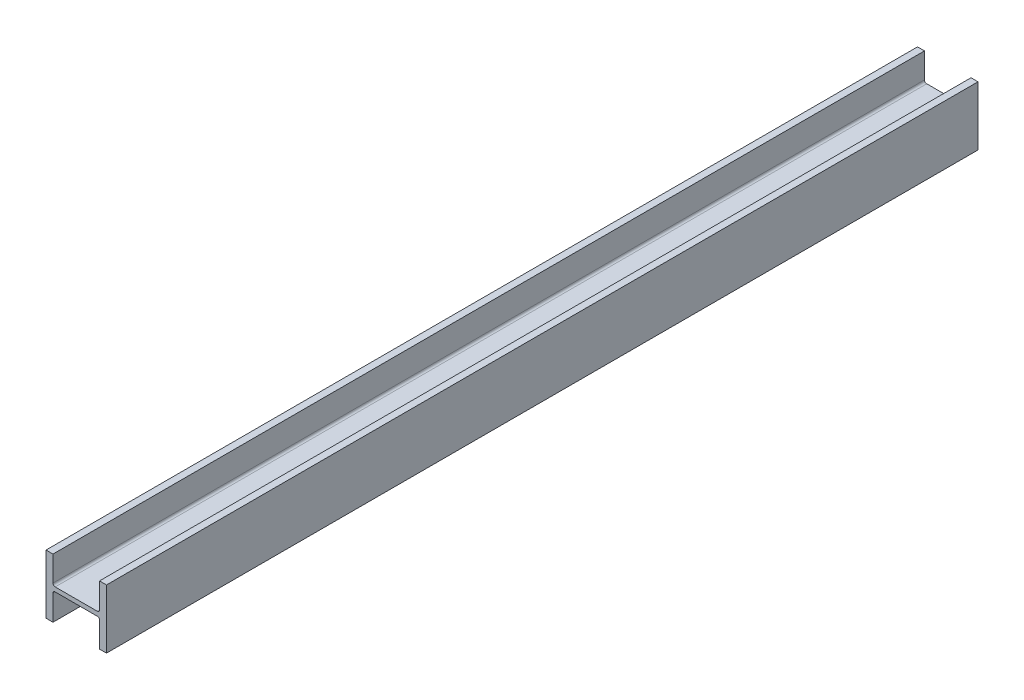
ISO-10303-21;
HEADER;
FILE_DESCRIPTION(('STEP AP214'),'2;1');
FILE_NAME('part.step','',(''),(''),'','','');
FILE_SCHEMA(('AUTOMOTIVE_DESIGN { 1 0 10303 214 1 1 1 1 }'));
ENDSEC;
DATA;
#1=APPLICATION_CONTEXT('core data for automotive mechanical design processes');
#2=APPLICATION_PROTOCOL_DEFINITION('international standard','automotive_design',2000,#1);
#3=PRODUCT_CONTEXT('',#1,'mechanical');
#4=PRODUCT('Part','Part','',(#3));
#5=PRODUCT_RELATED_PRODUCT_CATEGORY('part','',(#4));
#6=PRODUCT_DEFINITION_FORMATION('','',#4);
#7=PRODUCT_DEFINITION_CONTEXT('part definition',#1,'design');
#8=PRODUCT_DEFINITION('design','',#6,#7);
#9=PRODUCT_DEFINITION_SHAPE('','',#8);
#10=(LENGTH_UNIT() NAMED_UNIT(*) SI_UNIT(.MILLI.,.METRE.));
#11=(NAMED_UNIT(*) PLANE_ANGLE_UNIT() SI_UNIT($,.RADIAN.));
#12=(NAMED_UNIT(*) SI_UNIT($,.STERADIAN.) SOLID_ANGLE_UNIT());
#13=UNCERTAINTY_MEASURE_WITH_UNIT(LENGTH_MEASURE(1.E-05),#10,'distance_accuracy_value','');
#14=(GEOMETRIC_REPRESENTATION_CONTEXT(3) GLOBAL_UNCERTAINTY_ASSIGNED_CONTEXT((#13)) GLOBAL_UNIT_ASSIGNED_CONTEXT((#10,
#11,#12)) REPRESENTATION_CONTEXT('',''));
#15=CARTESIAN_POINT('',(0.,0.,0.));
#16=DIRECTION('',(0.,0.,1.));
#17=DIRECTION('',(1.,0.,0.));
#18=AXIS2_PLACEMENT_3D('',#15,#16,#17);
#19=CARTESIAN_POINT('',(208.026,203.1365,2997.2));
#20=DIRECTION('',(-1.,0.,0.));
#21=DIRECTION('',(0.,0.,1.));
#22=AXIS2_PLACEMENT_3D('',#19,#20,#21);
#23=PLANE('',#22);
#24=DIRECTION('',(0.,1.,0.));
#25=VECTOR('',#24,1.);
#26=CARTESIAN_POINT('',(208.026,203.1365,-2997.2));
#27=LINE('',#26,#25);
#28=CARTESIAN_POINT('',(208.026,-203.1365,-2997.2));
#29=VERTEX_POINT('',#28);
#30=CARTESIAN_POINT('',(208.026,203.1365,-2997.2));
#31=VERTEX_POINT('',#30);
#32=EDGE_CURVE('E193',#29,#31,#27,.T.);
#33=ORIENTED_EDGE('',*,*,#32,.T.);
#34=DIRECTION('',(0.,0.,-1.));
#35=VECTOR('',#34,1.);
#36=CARTESIAN_POINT('',(208.026,203.1365,2997.2));
#37=LINE('',#36,#35);
#38=CARTESIAN_POINT('',(208.026,203.1365,2997.2));
#39=VERTEX_POINT('',#38);
#40=EDGE_CURVE('E11',#39,#31,#37,.T.);
#41=ORIENTED_EDGE('',*,*,#40,.F.);
#42=DIRECTION('',(0.,1.,0.));
#43=VECTOR('',#42,1.);
#44=CARTESIAN_POINT('',(208.026,203.1365,2997.2));
#45=LINE('',#44,#43);
#46=CARTESIAN_POINT('',(208.026,-203.1365,2997.2));
#47=VERTEX_POINT('',#46);
#48=EDGE_CURVE('E238',#47,#39,#45,.T.);
#49=ORIENTED_EDGE('',*,*,#48,.F.);
#50=DIRECTION('',(0.,0.,-1.));
#51=VECTOR('',#50,1.);
#52=CARTESIAN_POINT('',(208.026,-203.1365,2997.2));
#53=LINE('',#52,#51);
#54=EDGE_CURVE('E187',#47,#29,#53,.T.);
#55=ORIENTED_EDGE('',*,*,#54,.T.);
#56=EDGE_LOOP('',(#33,#41,#49,#55));
#57=FACE_BOUND('',#56,.T.);
#58=ADVANCED_FACE('F44',(#57),#23,.F.);
#59=CARTESIAN_POINT('',(160.02,203.1365,2997.2));
#60=DIRECTION('',(0.,-1.,0.));
#61=DIRECTION('',(0.,0.,-1.));
#62=AXIS2_PLACEMENT_3D('',#59,#60,#61);
#63=PLANE('',#62);
#64=DIRECTION('',(-1.,0.,0.));
#65=VECTOR('',#64,1.);
#66=CARTESIAN_POINT('',(160.02,203.1365,-2997.2));
#67=LINE('',#66,#65);
#68=CARTESIAN_POINT('',(160.02,203.1365,-2997.2));
#69=VERTEX_POINT('',#68);
#70=EDGE_CURVE('E196',#31,#69,#67,.T.);
#71=ORIENTED_EDGE('',*,*,#70,.T.);
#72=DIRECTION('',(0.,0.,-1.));
#73=VECTOR('',#72,1.);
#74=CARTESIAN_POINT('',(160.02,203.1365,2997.2));
#75=LINE('',#74,#73);
#76=CARTESIAN_POINT('',(160.02,203.1365,2997.2));
#77=VERTEX_POINT('',#76);
#78=EDGE_CURVE('E53',#77,#69,#75,.T.);
#79=ORIENTED_EDGE('',*,*,#78,.F.);
#80=DIRECTION('',(-1.,0.,0.));
#81=VECTOR('',#80,1.);
#82=CARTESIAN_POINT('',(160.02,203.1365,2997.2));
#83=LINE('',#82,#81);
#84=EDGE_CURVE('E129',#39,#77,#83,.T.);
#85=ORIENTED_EDGE('',*,*,#84,.F.);
#86=ORIENTED_EDGE('',*,*,#40,.T.);
#87=EDGE_LOOP('',(#71,#79,#85,#86));
#88=FACE_BOUND('',#87,.T.);
#89=ADVANCED_FACE('F362',(#88),#63,.F.);
#90=CARTESIAN_POINT('',(160.02,30.1625000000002,2997.2));
#91=DIRECTION('',(1.,0.,0.));
#92=DIRECTION('',(0.,0.,-1.));
#93=AXIS2_PLACEMENT_3D('',#90,#91,#92);
#94=PLANE('',#93);
#95=DIRECTION('',(0.,-1.,0.));
#96=VECTOR('',#95,1.);
#97=CARTESIAN_POINT('',(160.02,30.1625000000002,-2997.2));
#98=LINE('',#97,#96);
#99=CARTESIAN_POINT('',(160.02,30.1625000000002,-2997.2));
#100=VERTEX_POINT('',#99);
#101=EDGE_CURVE('E203',#69,#100,#98,.T.);
#102=ORIENTED_EDGE('',*,*,#101,.T.);
#103=DIRECTION('',(0.,0.,-1.));
#104=VECTOR('',#103,1.);
#105=CARTESIAN_POINT('',(160.02,30.1625000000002,2997.2));
#106=LINE('',#105,#104);
#107=CARTESIAN_POINT('',(160.02,30.1625000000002,2997.2));
#108=VERTEX_POINT('',#107);
#109=EDGE_CURVE('E281',#108,#100,#106,.T.);
#110=ORIENTED_EDGE('',*,*,#109,.F.);
#111=DIRECTION('',(0.,-1.,0.));
#112=VECTOR('',#111,1.);
#113=CARTESIAN_POINT('',(160.02,30.1625000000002,2997.2));
#114=LINE('',#113,#112);
#115=EDGE_CURVE('E291',#77,#108,#114,.T.);
#116=ORIENTED_EDGE('',*,*,#115,.F.);
#117=ORIENTED_EDGE('',*,*,#78,.T.);
#118=EDGE_LOOP('',(#102,#110,#116,#117));
#119=FACE_BOUND('',#118,.T.);
#120=ADVANCED_FACE('F292',(#119),#94,.F.);
#121=CARTESIAN_POINT('',(144.78,30.1625000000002,2997.2));
#122=DIRECTION('',(0.,0.,-1.));
#123=DIRECTION('',(-1.,0.,0.));
#124=AXIS2_PLACEMENT_3D('',#121,#122,#123);
#125=CYLINDRICAL_SURFACE('',#124,15.24);
#126=CARTESIAN_POINT('',(144.78,30.1625000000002,-2997.2));
#127=DIRECTION('',(0.,0.,-1.));
#128=DIRECTION('',(1.,0.,0.));
#129=AXIS2_PLACEMENT_3D('',#126,#127,#128);
#130=CIRCLE('',#129,15.24);
#131=CARTESIAN_POINT('',(144.78,14.9225000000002,-2997.2));
#132=VERTEX_POINT('',#131);
#133=EDGE_CURVE('E204',#100,#132,#130,.T.);
#134=ORIENTED_EDGE('',*,*,#133,.T.);
#135=DIRECTION('',(0.,0.,-1.));
#136=VECTOR('',#135,1.);
#137=CARTESIAN_POINT('',(144.78,14.9225000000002,2997.2));
#138=LINE('',#137,#136);
#139=CARTESIAN_POINT('',(144.78,14.9225000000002,2997.2));
#140=VERTEX_POINT('',#139);
#141=EDGE_CURVE('E276',#140,#132,#138,.T.);
#142=ORIENTED_EDGE('',*,*,#141,.F.);
#143=CARTESIAN_POINT('',(144.78,30.1625000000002,2997.2));
#144=DIRECTION('',(0.,0.,-1.));
#145=DIRECTION('',(1.,0.,0.));
#146=AXIS2_PLACEMENT_3D('',#143,#144,#145);
#147=CIRCLE('',#146,15.24);
#148=EDGE_CURVE('E315',#108,#140,#147,.T.);
#149=ORIENTED_EDGE('',*,*,#148,.F.);
#150=ORIENTED_EDGE('',*,*,#109,.T.);
#151=EDGE_LOOP('',(#134,#142,#149,#150));
#152=FACE_BOUND('',#151,.T.);
#153=ADVANCED_FACE('F302',(#152),#125,.F.);
#154=CARTESIAN_POINT('',(-144.78,14.9225000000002,2997.2));
#155=DIRECTION('',(0.,-1.,0.));
#156=DIRECTION('',(1.,0.,0.));
#157=AXIS2_PLACEMENT_3D('',#154,#155,#156);
#158=PLANE('',#157);
#159=DIRECTION('',(-1.,0.,0.));
#160=VECTOR('',#159,1.);
#161=CARTESIAN_POINT('',(-144.78,14.9225000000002,-2997.2));
#162=LINE('',#161,#160);
#163=CARTESIAN_POINT('',(-144.78,14.9225000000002,-2997.2));
#164=VERTEX_POINT('',#163);
#165=EDGE_CURVE('E210',#132,#164,#162,.T.);
#166=ORIENTED_EDGE('',*,*,#165,.T.);
#167=DIRECTION('',(0.,0.,-1.));
#168=VECTOR('',#167,1.);
#169=CARTESIAN_POINT('',(-144.78,14.9225000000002,2997.2));
#170=LINE('',#169,#168);
#171=CARTESIAN_POINT('',(-144.78,14.9225000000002,2997.2));
#172=VERTEX_POINT('',#171);
#173=EDGE_CURVE('E274',#172,#164,#170,.T.);
#174=ORIENTED_EDGE('',*,*,#173,.F.);
#175=DIRECTION('',(-1.,0.,0.));
#176=VECTOR('',#175,1.);
#177=CARTESIAN_POINT('',(-144.78,14.9225000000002,2997.2));
#178=LINE('',#177,#176);
#179=EDGE_CURVE('E306',#140,#172,#178,.T.);
#180=ORIENTED_EDGE('',*,*,#179,.F.);
#181=ORIENTED_EDGE('',*,*,#141,.T.);
#182=EDGE_LOOP('',(#166,#174,#180,#181));
#183=FACE_BOUND('',#182,.T.);
#184=ADVANCED_FACE('F308',(#183),#158,.F.);
#185=CARTESIAN_POINT('',(-144.78,30.1625000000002,2997.2));
#186=DIRECTION('',(0.,0.,-1.));
#187=DIRECTION('',(-1.,0.,0.));
#188=AXIS2_PLACEMENT_3D('',#185,#186,#187);
#189=CYLINDRICAL_SURFACE('',#188,15.24);
#190=CARTESIAN_POINT('',(-144.78,30.1625000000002,-2997.2));
#191=DIRECTION('',(0.,0.,-1.));
#192=DIRECTION('',(1.,0.,0.));
#193=AXIS2_PLACEMENT_3D('',#190,#191,#192);
#194=CIRCLE('',#193,15.24);
#195=CARTESIAN_POINT('',(-160.02,30.1625000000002,-2997.2));
#196=VERTEX_POINT('',#195);
#197=EDGE_CURVE('E209',#164,#196,#194,.T.);
#198=ORIENTED_EDGE('',*,*,#197,.T.);
#199=DIRECTION('',(0.,0.,-1.));
#200=VECTOR('',#199,1.);
#201=CARTESIAN_POINT('',(-160.02,30.1625000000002,2997.2));
#202=LINE('',#201,#200);
#203=CARTESIAN_POINT('',(-160.02,30.1625000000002,2997.2));
#204=VERTEX_POINT('',#203);
#205=EDGE_CURVE('E271',#204,#196,#202,.T.);
#206=ORIENTED_EDGE('',*,*,#205,.F.);
#207=CARTESIAN_POINT('',(-144.78,30.1625000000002,2997.2));
#208=DIRECTION('',(0.,0.,-1.));
#209=DIRECTION('',(1.,0.,0.));
#210=AXIS2_PLACEMENT_3D('',#207,#208,#209);
#211=CIRCLE('',#210,15.24);
#212=EDGE_CURVE('E313',#172,#204,#211,.T.);
#213=ORIENTED_EDGE('',*,*,#212,.F.);
#214=ORIENTED_EDGE('',*,*,#173,.T.);
#215=EDGE_LOOP('',(#198,#206,#213,#214));
#216=FACE_BOUND('',#215,.T.);
#217=ADVANCED_FACE('F374',(#216),#189,.F.);
#218=CARTESIAN_POINT('',(-160.02,203.1365,2997.2));
#219=DIRECTION('',(-1.,0.,0.));
#220=DIRECTION('',(0.,0.,1.));
#221=AXIS2_PLACEMENT_3D('',#218,#219,#220);
#222=PLANE('',#221);
#223=DIRECTION('',(0.,1.,0.));
#224=VECTOR('',#223,1.);
#225=CARTESIAN_POINT('',(-160.02,203.1365,-2997.2));
#226=LINE('',#225,#224);
#227=CARTESIAN_POINT('',(-160.02,203.1365,-2997.2));
#228=VERTEX_POINT('',#227);
#229=EDGE_CURVE('E213',#196,#228,#226,.T.);
#230=ORIENTED_EDGE('',*,*,#229,.T.);
#231=DIRECTION('',(0.,0.,-1.));
#232=VECTOR('',#231,1.);
#233=CARTESIAN_POINT('',(-160.02,203.1365,2997.2));
#234=LINE('',#233,#232);
#235=CARTESIAN_POINT('',(-160.02,203.1365,2997.2));
#236=VERTEX_POINT('',#235);
#237=EDGE_CURVE('E270',#236,#228,#234,.T.);
#238=ORIENTED_EDGE('',*,*,#237,.F.);
#239=DIRECTION('',(0.,1.,0.));
#240=VECTOR('',#239,1.);
#241=CARTESIAN_POINT('',(-160.02,203.1365,2997.2));
#242=LINE('',#241,#240);
#243=EDGE_CURVE('E316',#204,#236,#242,.T.);
#244=ORIENTED_EDGE('',*,*,#243,.F.);
#245=ORIENTED_EDGE('',*,*,#205,.T.);
#246=EDGE_LOOP('',(#230,#238,#244,#245));
#247=FACE_BOUND('',#246,.T.);
#248=ADVANCED_FACE('F378',(#247),#222,.F.);
#249=CARTESIAN_POINT('',(-208.026,203.1365,2997.2));
#250=DIRECTION('',(0.,-1.,0.));
#251=DIRECTION('',(1.,0.,0.));
#252=AXIS2_PLACEMENT_3D('',#249,#250,#251);
#253=PLANE('',#252);
#254=DIRECTION('',(-1.,0.,0.));
#255=VECTOR('',#254,1.);
#256=CARTESIAN_POINT('',(-208.026,203.1365,-2997.2));
#257=LINE('',#256,#255);
#258=CARTESIAN_POINT('',(-208.026,203.1365,-2997.2));
#259=VERTEX_POINT('',#258);
#260=EDGE_CURVE('E216',#228,#259,#257,.T.);
#261=ORIENTED_EDGE('',*,*,#260,.T.);
#262=DIRECTION('',(0.,0.,-1.));
#263=VECTOR('',#262,1.);
#264=CARTESIAN_POINT('',(-208.026,203.1365,2997.2));
#265=LINE('',#264,#263);
#266=CARTESIAN_POINT('',(-208.026,203.1365,2997.2));
#267=VERTEX_POINT('',#266);
#268=EDGE_CURVE('E263',#267,#259,#265,.T.);
#269=ORIENTED_EDGE('',*,*,#268,.F.);
#270=DIRECTION('',(-1.,0.,0.));
#271=VECTOR('',#270,1.);
#272=CARTESIAN_POINT('',(-208.026,203.1365,2997.2));
#273=LINE('',#272,#271);
#274=EDGE_CURVE('E323',#236,#267,#273,.T.);
#275=ORIENTED_EDGE('',*,*,#274,.F.);
#276=ORIENTED_EDGE('',*,*,#237,.T.);
#277=EDGE_LOOP('',(#261,#269,#275,#276));
#278=FACE_BOUND('',#277,.T.);
#279=ADVANCED_FACE('F385',(#278),#253,.F.);
#280=CARTESIAN_POINT('',(-208.026,-203.1365,2997.2));
#281=DIRECTION('',(1.,0.,0.));
#282=DIRECTION('',(0.,0.,-1.));
#283=AXIS2_PLACEMENT_3D('',#280,#281,#282);
#284=PLANE('',#283);
#285=DIRECTION('',(0.,-1.,0.));
#286=VECTOR('',#285,1.);
#287=CARTESIAN_POINT('',(-208.026,-203.1365,-2997.2));
#288=LINE('',#287,#286);
#289=CARTESIAN_POINT('',(-208.026,-203.1365,-2997.2));
#290=VERTEX_POINT('',#289);
#291=EDGE_CURVE('E218',#259,#290,#288,.T.);
#292=ORIENTED_EDGE('',*,*,#291,.T.);
#293=DIRECTION('',(0.,0.,-1.));
#294=VECTOR('',#293,1.);
#295=CARTESIAN_POINT('',(-208.026,-203.1365,2997.2));
#296=LINE('',#295,#294);
#297=CARTESIAN_POINT('',(-208.026,-203.1365,2997.2));
#298=VERTEX_POINT('',#297);
#299=EDGE_CURVE('E259',#298,#290,#296,.T.);
#300=ORIENTED_EDGE('',*,*,#299,.F.);
#301=DIRECTION('',(0.,-1.,0.));
#302=VECTOR('',#301,1.);
#303=CARTESIAN_POINT('',(-208.026,-203.1365,2997.2));
#304=LINE('',#303,#302);
#305=EDGE_CURVE('E326',#267,#298,#304,.T.);
#306=ORIENTED_EDGE('',*,*,#305,.F.);
#307=ORIENTED_EDGE('',*,*,#268,.T.);
#308=EDGE_LOOP('',(#292,#300,#306,#307));
#309=FACE_BOUND('',#308,.T.);
#310=ADVANCED_FACE('F387',(#309),#284,.F.);
#311=CARTESIAN_POINT('',(-160.02,-203.1365,2997.2));
#312=DIRECTION('',(0.,1.,0.));
#313=DIRECTION('',(0.,0.,1.));
#314=AXIS2_PLACEMENT_3D('',#311,#312,#313);
#315=PLANE('',#314);
#316=DIRECTION('',(1.,0.,0.));
#317=VECTOR('',#316,1.);
#318=CARTESIAN_POINT('',(-160.02,-203.1365,-2997.2));
#319=LINE('',#318,#317);
#320=CARTESIAN_POINT('',(-160.02,-203.1365,-2997.2));
#321=VERTEX_POINT('',#320);
#322=EDGE_CURVE('E225',#290,#321,#319,.T.);
#323=ORIENTED_EDGE('',*,*,#322,.T.);
#324=DIRECTION('',(0.,0.,-1.));
#325=VECTOR('',#324,1.);
#326=CARTESIAN_POINT('',(-160.02,-203.1365,2997.2));
#327=LINE('',#326,#325);
#328=CARTESIAN_POINT('',(-160.02,-203.1365,2997.2));
#329=VERTEX_POINT('',#328);
#330=EDGE_CURVE('E254',#329,#321,#327,.T.);
#331=ORIENTED_EDGE('',*,*,#330,.F.);
#332=DIRECTION('',(1.,0.,0.));
#333=VECTOR('',#332,1.);
#334=CARTESIAN_POINT('',(-160.02,-203.1365,2997.2));
#335=LINE('',#334,#333);
#336=EDGE_CURVE('E328',#298,#329,#335,.T.);
#337=ORIENTED_EDGE('',*,*,#336,.F.);
#338=ORIENTED_EDGE('',*,*,#299,.T.);
#339=EDGE_LOOP('',(#323,#331,#337,#338));
#340=FACE_BOUND('',#339,.T.);
#341=ADVANCED_FACE('F388',(#340),#315,.F.);
#342=CARTESIAN_POINT('',(-160.02,-30.1624999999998,2997.2));
#343=DIRECTION('',(-1.,0.,0.));
#344=DIRECTION('',(0.,0.,1.));
#345=AXIS2_PLACEMENT_3D('',#342,#343,#344);
#346=PLANE('',#345);
#347=DIRECTION('',(0.,1.,0.));
#348=VECTOR('',#347,1.);
#349=CARTESIAN_POINT('',(-160.02,-30.1624999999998,-2997.2));
#350=LINE('',#349,#348);
#351=CARTESIAN_POINT('',(-160.02,-30.1624999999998,-2997.2));
#352=VERTEX_POINT('',#351);
#353=EDGE_CURVE('E223',#321,#352,#350,.T.);
#354=ORIENTED_EDGE('',*,*,#353,.T.);
#355=DIRECTION('',(0.,0.,-1.));
#356=VECTOR('',#355,1.);
#357=CARTESIAN_POINT('',(-160.02,-30.1624999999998,2997.2));
#358=LINE('',#357,#356);
#359=CARTESIAN_POINT('',(-160.02,-30.1624999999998,2997.2));
#360=VERTEX_POINT('',#359);
#361=EDGE_CURVE('E253',#360,#352,#358,.T.);
#362=ORIENTED_EDGE('',*,*,#361,.F.);
#363=DIRECTION('',(0.,1.,0.));
#364=VECTOR('',#363,1.);
#365=CARTESIAN_POINT('',(-160.02,-30.1624999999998,2997.2));
#366=LINE('',#365,#364);
#367=EDGE_CURVE('E335',#329,#360,#366,.T.);
#368=ORIENTED_EDGE('',*,*,#367,.F.);
#369=ORIENTED_EDGE('',*,*,#330,.T.);
#370=EDGE_LOOP('',(#354,#362,#368,#369));
#371=FACE_BOUND('',#370,.T.);
#372=ADVANCED_FACE('F394',(#371),#346,.F.);
#373=CARTESIAN_POINT('',(-144.78,-30.1624999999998,2997.2));
#374=DIRECTION('',(0.,0.,-1.));
#375=DIRECTION('',(-1.,0.,0.));
#376=AXIS2_PLACEMENT_3D('',#373,#374,#375);
#377=CYLINDRICAL_SURFACE('',#376,15.24);
#378=CARTESIAN_POINT('',(-144.78,-30.1624999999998,-2997.2));
#379=DIRECTION('',(0.,0.,-1.));
#380=DIRECTION('',(1.,0.,0.));
#381=AXIS2_PLACEMENT_3D('',#378,#379,#380);
#382=CIRCLE('',#381,15.24);
#383=CARTESIAN_POINT('',(-144.78,-14.9224999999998,-2997.2));
#384=VERTEX_POINT('',#383);
#385=EDGE_CURVE('E226',#352,#384,#382,.T.);
#386=ORIENTED_EDGE('',*,*,#385,.T.);
#387=DIRECTION('',(0.,0.,-1.));
#388=VECTOR('',#387,1.);
#389=CARTESIAN_POINT('',(-144.78,-14.9224999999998,2997.2));
#390=LINE('',#389,#388);
#391=CARTESIAN_POINT('',(-144.78,-14.9224999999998,2997.2));
#392=VERTEX_POINT('',#391);
#393=EDGE_CURVE('E247',#392,#384,#390,.T.);
#394=ORIENTED_EDGE('',*,*,#393,.F.);
#395=CARTESIAN_POINT('',(-144.78,-30.1624999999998,2997.2));
#396=DIRECTION('',(0.,0.,-1.));
#397=DIRECTION('',(1.,0.,0.));
#398=AXIS2_PLACEMENT_3D('',#395,#396,#397);
#399=CIRCLE('',#398,15.24);
#400=EDGE_CURVE('E333',#360,#392,#399,.T.);
#401=ORIENTED_EDGE('',*,*,#400,.F.);
#402=ORIENTED_EDGE('',*,*,#361,.T.);
#403=EDGE_LOOP('',(#386,#394,#401,#402));
#404=FACE_BOUND('',#403,.T.);
#405=ADVANCED_FACE('F344',(#404),#377,.F.);
#406=CARTESIAN_POINT('',(144.78,-14.9224999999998,2997.2));
#407=DIRECTION('',(0.,1.,0.));
#408=DIRECTION('',(0.,0.,1.));
#409=AXIS2_PLACEMENT_3D('',#406,#407,#408);
#410=PLANE('',#409);
#411=DIRECTION('',(1.,0.,0.));
#412=VECTOR('',#411,1.);
#413=CARTESIAN_POINT('',(144.78,-14.9224999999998,-2997.2));
#414=LINE('',#413,#412);
#415=CARTESIAN_POINT('',(144.78,-14.9224999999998,-2997.2));
#416=VERTEX_POINT('',#415);
#417=EDGE_CURVE('E231',#384,#416,#414,.T.);
#418=ORIENTED_EDGE('',*,*,#417,.T.);
#419=DIRECTION('',(0.,0.,-1.));
#420=VECTOR('',#419,1.);
#421=CARTESIAN_POINT('',(144.78,-14.9224999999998,2997.2));
#422=LINE('',#421,#420);
#423=CARTESIAN_POINT('',(144.78,-14.9224999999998,2997.2));
#424=VERTEX_POINT('',#423);
#425=EDGE_CURVE('E181',#424,#416,#422,.T.);
#426=ORIENTED_EDGE('',*,*,#425,.F.);
#427=DIRECTION('',(1.,0.,0.));
#428=VECTOR('',#427,1.);
#429=CARTESIAN_POINT('',(144.78,-14.9224999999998,2997.2));
#430=LINE('',#429,#428);
#431=EDGE_CURVE('E175',#392,#424,#430,.T.);
#432=ORIENTED_EDGE('',*,*,#431,.F.);
#433=ORIENTED_EDGE('',*,*,#393,.T.);
#434=EDGE_LOOP('',(#418,#426,#432,#433));
#435=FACE_BOUND('',#434,.T.);
#436=ADVANCED_FACE('F350',(#435),#410,.F.);
#437=CARTESIAN_POINT('',(144.78,-30.1624999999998,2997.2));
#438=DIRECTION('',(0.,0.,-1.));
#439=DIRECTION('',(-1.,0.,0.));
#440=AXIS2_PLACEMENT_3D('',#437,#438,#439);
#441=CYLINDRICAL_SURFACE('',#440,15.24);
#442=CARTESIAN_POINT('',(144.78,-30.1624999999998,-2997.2));
#443=DIRECTION('',(0.,0.,-1.));
#444=DIRECTION('',(1.,0.,0.));
#445=AXIS2_PLACEMENT_3D('',#442,#443,#444);
#446=CIRCLE('',#445,15.24);
#447=CARTESIAN_POINT('',(160.02,-30.1624999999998,-2997.2));
#448=VERTEX_POINT('',#447);
#449=EDGE_CURVE('E182',#416,#448,#446,.T.);
#450=ORIENTED_EDGE('',*,*,#449,.T.);
#451=DIRECTION('',(0.,0.,-1.));
#452=VECTOR('',#451,1.);
#453=CARTESIAN_POINT('',(160.02,-30.1624999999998,2997.2));
#454=LINE('',#453,#452);
#455=CARTESIAN_POINT('',(160.02,-30.1624999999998,2997.2));
#456=VERTEX_POINT('',#455);
#457=EDGE_CURVE('E179',#456,#448,#454,.T.);
#458=ORIENTED_EDGE('',*,*,#457,.F.);
#459=CARTESIAN_POINT('',(144.78,-30.1624999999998,2997.2));
#460=DIRECTION('',(0.,0.,-1.));
#461=DIRECTION('',(1.,0.,0.));
#462=AXIS2_PLACEMENT_3D('',#459,#460,#461);
#463=CIRCLE('',#462,15.24);
#464=EDGE_CURVE('E167',#424,#456,#463,.T.);
#465=ORIENTED_EDGE('',*,*,#464,.F.);
#466=ORIENTED_EDGE('',*,*,#425,.T.);
#467=EDGE_LOOP('',(#450,#458,#465,#466));
#468=FACE_BOUND('',#467,.T.);
#469=ADVANCED_FACE('F178',(#468),#441,.F.);
#470=CARTESIAN_POINT('',(160.02,-203.1365,2997.2));
#471=DIRECTION('',(1.,0.,0.));
#472=DIRECTION('',(0.,0.,-1.));
#473=AXIS2_PLACEMENT_3D('',#470,#471,#472);
#474=PLANE('',#473);
#475=DIRECTION('',(0.,-1.,0.));
#476=VECTOR('',#475,1.);
#477=CARTESIAN_POINT('',(160.02,-203.1365,-2997.2));
#478=LINE('',#477,#476);
#479=CARTESIAN_POINT('',(160.02,-203.1365,-2997.2));
#480=VERTEX_POINT('',#479);
#481=EDGE_CURVE('E113',#448,#480,#478,.T.);
#482=ORIENTED_EDGE('',*,*,#481,.T.);
#483=DIRECTION('',(0.,0.,-1.));
#484=VECTOR('',#483,1.);
#485=CARTESIAN_POINT('',(160.02,-203.1365,2997.2));
#486=LINE('',#485,#484);
#487=CARTESIAN_POINT('',(160.02,-203.1365,2997.2));
#488=VERTEX_POINT('',#487);
#489=EDGE_CURVE('E184',#488,#480,#486,.T.);
#490=ORIENTED_EDGE('',*,*,#489,.F.);
#491=DIRECTION('',(0.,-1.,0.));
#492=VECTOR('',#491,1.);
#493=CARTESIAN_POINT('',(160.02,-203.1365,2997.2));
#494=LINE('',#493,#492);
#495=EDGE_CURVE('E168',#456,#488,#494,.T.);
#496=ORIENTED_EDGE('',*,*,#495,.F.);
#497=ORIENTED_EDGE('',*,*,#457,.T.);
#498=EDGE_LOOP('',(#482,#490,#496,#497));
#499=FACE_BOUND('',#498,.T.);
#500=ADVANCED_FACE('F188',(#499),#474,.F.);
#501=CARTESIAN_POINT('',(208.026,-203.1365,2997.2));
#502=DIRECTION('',(0.,1.,0.));
#503=DIRECTION('',(0.,0.,1.));
#504=AXIS2_PLACEMENT_3D('',#501,#502,#503);
#505=PLANE('',#504);
#506=DIRECTION('',(1.,0.,0.));
#507=VECTOR('',#506,1.);
#508=CARTESIAN_POINT('',(208.026,-203.1365,-2997.2));
#509=LINE('',#508,#507);
#510=EDGE_CURVE('E121',#480,#29,#509,.T.);
#511=ORIENTED_EDGE('',*,*,#510,.T.);
#512=ORIENTED_EDGE('',*,*,#54,.F.);
#513=DIRECTION('',(1.,0.,0.));
#514=VECTOR('',#513,1.);
#515=CARTESIAN_POINT('',(208.026,-203.1365,2997.2));
#516=LINE('',#515,#514);
#517=EDGE_CURVE('E65',#488,#47,#516,.T.);
#518=ORIENTED_EDGE('',*,*,#517,.F.);
#519=ORIENTED_EDGE('',*,*,#489,.T.);
#520=EDGE_LOOP('',(#511,#512,#518,#519));
#521=FACE_BOUND('',#520,.T.);
#522=ADVANCED_FACE('F353',(#521),#505,.F.);
#523=CARTESIAN_POINT('',(144.78,-30.1624999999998,2997.2));
#524=DIRECTION('',(0.,0.,1.));
#525=DIRECTION('',(1.,0.,0.));
#526=AXIS2_PLACEMENT_3D('',#523,#524,#525);
#527=PLANE('',#526);
#528=ORIENTED_EDGE('',*,*,#48,.T.);
#529=ORIENTED_EDGE('',*,*,#84,.T.);
#530=ORIENTED_EDGE('',*,*,#115,.T.);
#531=ORIENTED_EDGE('',*,*,#148,.T.);
#532=ORIENTED_EDGE('',*,*,#179,.T.);
#533=ORIENTED_EDGE('',*,*,#212,.T.);
#534=ORIENTED_EDGE('',*,*,#243,.T.);
#535=ORIENTED_EDGE('',*,*,#274,.T.);
#536=ORIENTED_EDGE('',*,*,#305,.T.);
#537=ORIENTED_EDGE('',*,*,#336,.T.);
#538=ORIENTED_EDGE('',*,*,#367,.T.);
#539=ORIENTED_EDGE('',*,*,#400,.T.);
#540=ORIENTED_EDGE('',*,*,#431,.T.);
#541=ORIENTED_EDGE('',*,*,#464,.T.);
#542=ORIENTED_EDGE('',*,*,#495,.T.);
#543=ORIENTED_EDGE('',*,*,#517,.T.);
#544=EDGE_LOOP('',(#528,#529,#530,#531,#532,#533,#534,#535,#536,#537,#538,#539,#540,#541,#542,#543));
#545=FACE_BOUND('',#544,.T.);
#546=ADVANCED_FACE('F169',(#545),#527,.T.);
#547=CARTESIAN_POINT('',(144.78,-30.1624999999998,-2997.2));
#548=DIRECTION('',(0.,0.,1.));
#549=DIRECTION('',(1.,0.,0.));
#550=AXIS2_PLACEMENT_3D('',#547,#548,#549);
#551=PLANE('',#550);
#552=ORIENTED_EDGE('',*,*,#32,.F.);
#553=ORIENTED_EDGE('',*,*,#510,.F.);
#554=ORIENTED_EDGE('',*,*,#481,.F.);
#555=ORIENTED_EDGE('',*,*,#449,.F.);
#556=ORIENTED_EDGE('',*,*,#417,.F.);
#557=ORIENTED_EDGE('',*,*,#385,.F.);
#558=ORIENTED_EDGE('',*,*,#353,.F.);
#559=ORIENTED_EDGE('',*,*,#322,.F.);
#560=ORIENTED_EDGE('',*,*,#291,.F.);
#561=ORIENTED_EDGE('',*,*,#260,.F.);
#562=ORIENTED_EDGE('',*,*,#229,.F.);
#563=ORIENTED_EDGE('',*,*,#197,.F.);
#564=ORIENTED_EDGE('',*,*,#165,.F.);
#565=ORIENTED_EDGE('',*,*,#133,.F.);
#566=ORIENTED_EDGE('',*,*,#101,.F.);
#567=ORIENTED_EDGE('',*,*,#70,.F.);
#568=EDGE_LOOP('',(#552,#553,#554,#555,#556,#557,#558,#559,#560,#561,#562,#563,#564,#565,#566,#567));
#569=FACE_BOUND('',#568,.T.);
#570=ADVANCED_FACE('F300',(#569),#551,.F.);
#571=CLOSED_SHELL('',(#58,#89,#120,#153,#184,#217,#248,#279,#310,#341,#372,#405,#436,#469,#500,
#522,#546,#570));
#572=MANIFOLD_SOLID_BREP('B2',#571);
#573=ADVANCED_BREP_SHAPE_REPRESENTATION('',(#18,#572),#14);
#574=SHAPE_DEFINITION_REPRESENTATION(#9,#573);
ENDSEC;
END-ISO-10303-21;
